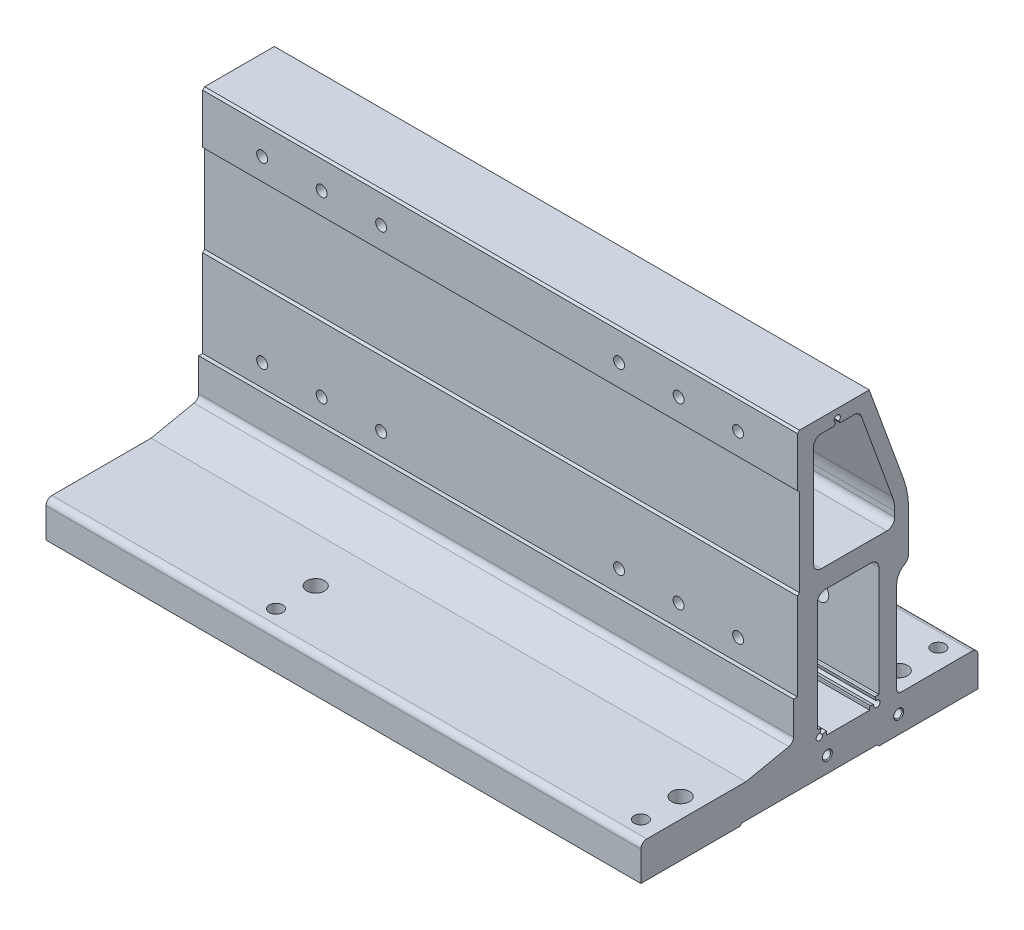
from build123d import *

# Parameters (mm, degrees)
EXTRUDE_1_DEPTH                = 150
HOLE_WIZARD_M5_1_D             = 5.5
HOLE_WIZARD_M5_1_CBORE_D       = 9.5
HOLE_WIZARD_M5_1_CBORE_DEPTH   = 49
PATTERN_LINEAR_1_COUNT         = 2
PATTERN_LINEAR_1_PITCH         = 180
HOLE_WIZARD_M5_1_2_D           = 4.2
HOLE_WIZARD_M5_1_2_DEPTH       = 12
HOLE_WIZARD_M5_1_2_CSINK_D     = 5.05
HOLE_WIZARD_M5_1_2_CSINK_ANGLE = 90
HOLE_WIZARD_M5_1_2_TIP         = 1.2618073
HOLE_WIZARD_M8_1_D             = 6.8
HOLE_WIZARD_M8_1_CSINK_D       = 8.05
HOLE_WIZARD_M8_1_CSINK_ANGLE   = 90
F_6_0MM_1_D                    = 6
F_6_0MM_1_DEPTH                = 10
F_6_0MM_1_TIP                  = 1.802581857
HOLE_WIZARD_9_0_9_1_D          = 9


with BuildPart() as part:
    # Sketch 1 → Extrude 1 (new, symmetric)
    with BuildSketch(Plane(origin=(0, 0, 0), x_dir=(0, 0, -1), z_dir=(1, 0, 0))):
        with BuildLine():
            Line((-5, 156.999997), (-6, 155.999997))
            Line((-6, 155.999997), (-6, 131))
            Line((-6, 131), (-5, 130))
            Line((-5, 130), (-5, 86))
            Line((-5, 86), (-6, 85))
            Line((-6, 85), (-6, 40.999831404))
            Line((-6, 40.999831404), (-8, 40.999831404))
            Line((-8, 40.999831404), (-8, 24.439412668))
            ThreePointArc((-8, 24.439412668), (-8.672384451, 22.546741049), (-10.388137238, 21.502471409))
            Line((-10.388137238, 21.502471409), (-32, 17))
            Line((-32, 17), (-82, 17))
            ThreePointArc((-82, 17), (-84.121320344, 16.121320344), (-85, 14))
            Line((-85, 14), (-85, -1))
            Line((-85, -1), (-35, -1))
            Line((-35, -1), (-34, 0))
            Line((-34, 0), (34, 0))
            Line((34, 0), (35, -1))
            Line((35, -1), (85, -1))
            Line((85, -1), (85, 14))
            ThreePointArc((85, 14), (84.121320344, 16.121320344), (82, 17))
            Line((82, 17), (46, 17))
            ThreePointArc((46, 17), (44.585786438, 17.585786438), (44, 19))
            Line((44, 19), (44, 65))
            ThreePointArc((44, 65), (45.07179677, 69), (48, 71.92820323))
            ThreePointArc((48, 71.92820323), (49.464101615, 73.392304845), (50, 75.392304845))
            Line((50, 75.392304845), (50, 95.442037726))
            ThreePointArc((50, 95.442037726), (49.391487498, 102.392628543), (47.584464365, 109.131743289))
            Line((47.584464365, 109.131743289), (30.149007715, 156.999997))
            Line((30.149007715, 156.999997), (-5, 156.999997))
        make_face()
        with BuildLine():
            Line((2, 146), (2, 95))
            ThreePointArc((2, 95), (3.171572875, 92.171572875), (6, 91))
            Line((6, 91), (39, 91))
            ThreePointArc((39, 91), (41.828427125, 92.171572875), (43, 95))
            Line((43, 95), (43, 97.735875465))
            ThreePointArc((43, 97.735875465), (42.695743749, 101.211170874), (41.792232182, 104.580728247))
            Line((41.792232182, 104.580728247), (26.207110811, 147.368970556))
            ThreePointArc((26.207110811, 147.368970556), (24.742582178, 149.276879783), (22.448664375, 150))
            Line((22.448664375, 150), (15.443373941, 150))
            Line((15.443373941, 150), (14.8, 151.114356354))
            ThreePointArc((14.8, 151.114356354), (14, 154.099997), (13.2, 151.114356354))
            Line((13.2, 151.114356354), (12.556626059, 150))
            Line((12.556626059, 150), (6, 150))
            ThreePointArc((6, 150), (3.171572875, 148.828427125), (2, 146))
        make_face(mode=Mode.SUBTRACT)
        with BuildLine():
            Line((4, 77), (4, 21.6))
            Line((4, 21.6), (5, 21.6))
            ThreePointArc((5, 21.6), (5.469894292, 21.569201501), (5.931748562, 21.477332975))
            Line((5.931748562, 21.477332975), (5.414110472, 19.545481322))
            ThreePointArc((5.414110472, 19.545481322), (3.86862915, 16.86862915), (6.545481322, 18.414110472))
            Line((6.545481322, 18.414110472), (8.477332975, 18.931748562))
            ThreePointArc((8.477332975, 18.931748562), (8.569201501, 18.469894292), (8.6, 18))
            Line((8.6, 18), (8.6, 17))
            Line((8.6, 17), (30.4, 17))
            Line((30.4, 17), (30.4, 18))
            ThreePointArc((30.4, 18), (30.430798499, 18.469894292), (30.522667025, 18.931748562))
            Line((30.522667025, 18.931748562), (32.454518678, 18.414110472))
            ThreePointArc((32.454518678, 18.414110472), (35.13137085, 16.86862915), (33.585889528, 19.545481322))
            Line((33.585889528, 19.545481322), (33.068251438, 21.477332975))
            ThreePointArc((33.068251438, 21.477332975), (33.530105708, 21.569201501), (34, 21.6))
            Line((34, 21.6), (35, 21.6))
            Line((35, 21.6), (35, 77))
            ThreePointArc((35, 77), (33.828427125, 79.828427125), (31, 81))
            Line((31, 81), (8, 81))
            ThreePointArc((8, 81), (5.171572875, 79.828427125), (4, 77))
        make_face(mode=Mode.SUBTRACT)
    extrude(amount=EXTRUDE_1_DEPTH, both=True)

    # Hole Wizard M5 _ _ _ _ _1 (through all)
    with Locations(Plane(origin=(0, 0, -50), x_dir=(-1, 0, 0), z_dir=(0, 0, -1))):
        with Locations((-120, 142), (-60, 142), (-90, 142), (-120, 52), (-90, 52), (-60, 52)):
            hole_wizard_m5_1 = CounterBoreHole(HOLE_WIZARD_M5_1_D / 2, HOLE_WIZARD_M5_1_CBORE_D / 2, HOLE_WIZARD_M5_1_CBORE_DEPTH)

    # Pattern Linear 1: Hole Wizard M5 _ _ _ _ _1 ×2
    with Locations(*[(-i * PATTERN_LINEAR_1_PITCH, 0, 0) for i in range(1, PATTERN_LINEAR_1_COUNT)]):
        add(hole_wizard_m5_1, mode=Mode.SUBTRACT)

    # Hole Wizard M5 _ _1 2
    with Locations(Plane(origin=(150, 0, 0), x_dir=(0, 0, -1), z_dir=(1, 0, 0))):
        with Locations((9, 8), (45, 8)):
            CounterSinkHole(HOLE_WIZARD_M5_1_2_D / 2, HOLE_WIZARD_M5_1_2_CSINK_D / 2, depth=HOLE_WIZARD_M5_1_2_DEPTH, counter_sink_angle=HOLE_WIZARD_M5_1_2_CSINK_ANGLE)
            with Locations((0, 0, -(HOLE_WIZARD_M5_1_2_DEPTH + HOLE_WIZARD_M5_1_2_TIP / 2))):  # 118° drill point
                Cone(0, HOLE_WIZARD_M5_1_2_D / 2, HOLE_WIZARD_M5_1_2_TIP, mode=Mode.SUBTRACT)

    # Hole Wizard M8 _ _1 (through all)
    with Locations(Plane(origin=(0, -1, 0), x_dir=(-1, 0, 0), z_dir=(0, -1, 0))):
        with Locations((44, -75), (-140, -75), (44, 75), (-140, 75)):
            CounterSinkHole(HOLE_WIZARD_M8_1_D / 2, HOLE_WIZARD_M8_1_CSINK_D / 2, counter_sink_angle=HOLE_WIZARD_M8_1_CSINK_ANGLE)

    # 6.0mm _ _1
    with Locations(Plane(origin=(0, 0, 0), x_dir=(-1, 0, 0), z_dir=(0, -1, 0))):
        with Locations((44, 0), (-140, 0)):
            Hole(F_6_0MM_1_D / 2, depth=F_6_0MM_1_DEPTH)
            with Locations((0, 0, -(F_6_0MM_1_DEPTH + F_6_0MM_1_TIP / 2))):  # 118° drill point
                Cone(0, F_6_0MM_1_D / 2, F_6_0MM_1_TIP, mode=Mode.SUBTRACT)

    # Hole Wizard 9.0 _9_ _ _1 (through all)
    with Locations(Plane(origin=(0, -1, 0), x_dir=(-1, 0, 0), z_dir=(0, -1, 0))):
        with Locations((44, -55), (-140, -55), (44, 55), (-140, 55)):
            Hole(HOLE_WIZARD_9_0_9_1_D / 2)


solid = part.part
